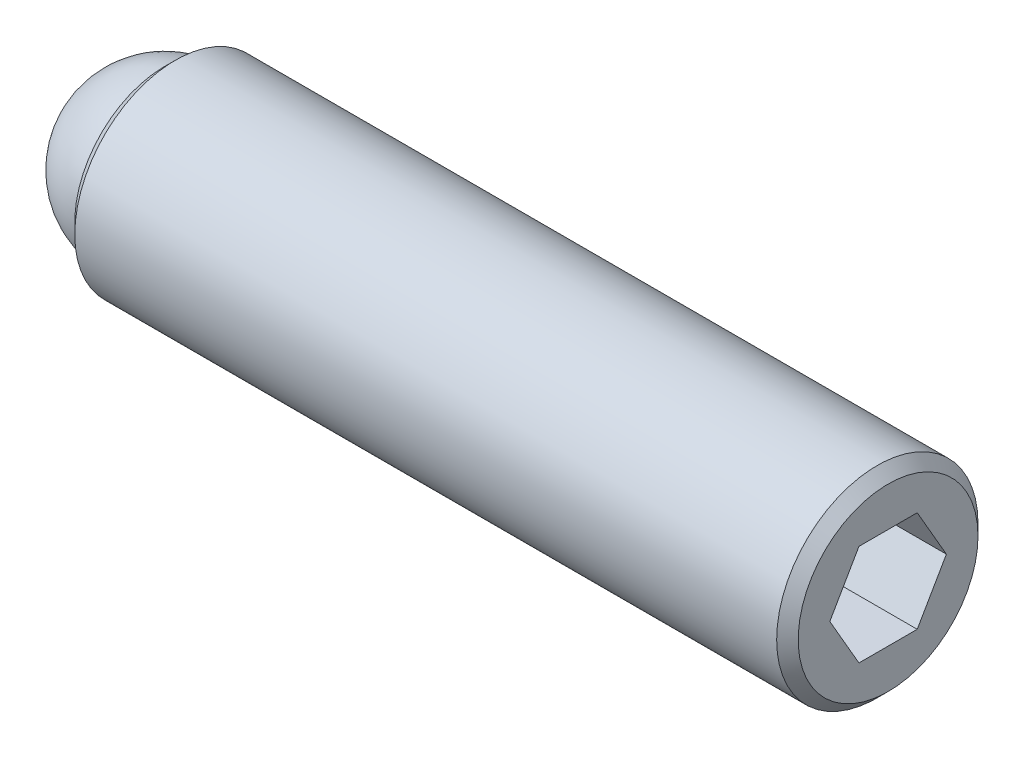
from build123d import *

# Parameters (mm, degrees)
SKETCH2_R           = 2.3749
BOSS_EXTRUDE1_DEPTH = 17.065625
CHAMFER1_SIZE       = 0.254
CHAMFER2_SIZE       = 0.254
CUT_EXTRUDE2_DEPTH  = 2.286
SKETCH3_R           = 1.9812
CUT_EXTRUDE3_DEPTH  = 1.984375


with BuildPart() as part:
    # Sketch2 → Boss-Extrude1 (new body)
    with BuildSketch(Plane(origin=(0, 0, 0), x_dir=(0, 0, -1), z_dir=(1, 0, 0))):
        Circle(SKETCH2_R)
    extrude(amount=BOSS_EXTRUDE1_DEPTH)

    # Chamfer1
    chamfer1_edges = [part.edges().sort_by_distance(p)[0] for p in [
        (0, 0, 2.3749),
    ]]
    chamfer(chamfer1_edges, length=CHAMFER1_SIZE)

    # Chamfer2
    chamfer2_edges = [part.edges().sort_by_distance(p)[0] for p in [
        (17.065625, 0, 2.3749),
    ]]
    chamfer(chamfer2_edges, length=CHAMFER2_SIZE)

    # Sketch4 → Cut-Extrude2 (cut)
    with BuildSketch(Plane(origin=(17.065625, 0, 0), x_dir=(0, 0, -1), z_dir=(1, 0, 0))):
        Polygon((1.374815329, 0), (0.687407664, 1.190625), (-0.687407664, 1.190625), (-1.374815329, 0), (-0.687407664, -1.190625), (0.687407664, -1.190625), align=None)
    extrude(amount=-CUT_EXTRUDE2_DEPTH, mode=Mode.SUBTRACT)

    # Sketch3 → Cut-Extrude3 (cut)
    with BuildSketch(Plane.ZY):
        Circle(SKETCH3_R)
    extrude(amount=-CUT_EXTRUDE3_DEPTH, mode=Mode.SUBTRACT)


with BuildPart() as body_2:
    # Sketch5 → Revolve1 (revolve)
    with BuildSketch(Plane.ZY):
        with BuildLine():
            Line((0, 0), (0, -1.984375))
            ThreePointArc((0, -1.984375), (-1.984375, 0), (0, 1.984375))
            Line((0, 1.984375), (0, 0))
        make_face()
    revolve(axis=Axis((0, 0, 0), (0, 1, 0)))


solid = Compound([part.part, body_2.part])
